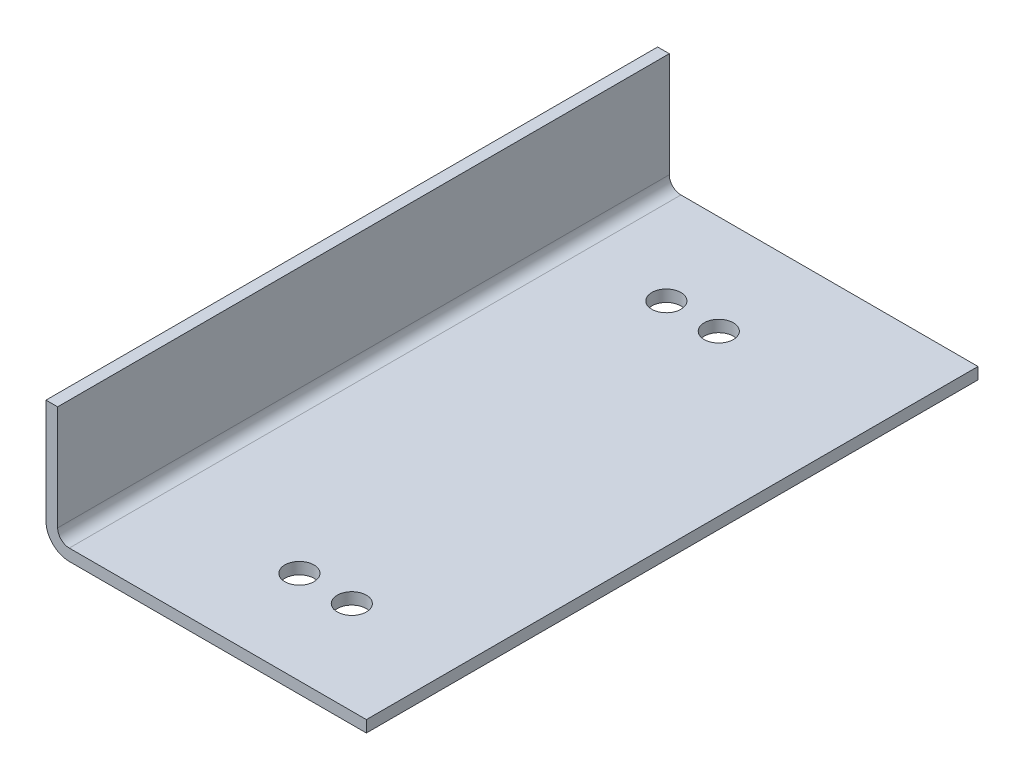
ISO-10303-21;
HEADER;
FILE_DESCRIPTION(('STEP AP214'),'2;1');
FILE_NAME('part.step','',(''),(''),'','','');
FILE_SCHEMA(('AUTOMOTIVE_DESIGN { 1 0 10303 214 1 1 1 1 }'));
ENDSEC;
DATA;
#1=APPLICATION_CONTEXT('core data for automotive mechanical design processes');
#2=APPLICATION_PROTOCOL_DEFINITION('international standard','automotive_design',2000,#1);
#3=PRODUCT_CONTEXT('',#1,'mechanical');
#4=PRODUCT('Part','Part','',(#3));
#5=PRODUCT_RELATED_PRODUCT_CATEGORY('part','',(#4));
#6=PRODUCT_DEFINITION_FORMATION('','',#4);
#7=PRODUCT_DEFINITION_CONTEXT('part definition',#1,'design');
#8=PRODUCT_DEFINITION('design','',#6,#7);
#9=PRODUCT_DEFINITION_SHAPE('','',#8);
#10=(LENGTH_UNIT() NAMED_UNIT(*) SI_UNIT(.MILLI.,.METRE.));
#11=(NAMED_UNIT(*) PLANE_ANGLE_UNIT() SI_UNIT($,.RADIAN.));
#12=(NAMED_UNIT(*) SI_UNIT($,.STERADIAN.) SOLID_ANGLE_UNIT());
#13=UNCERTAINTY_MEASURE_WITH_UNIT(LENGTH_MEASURE(1.E-05),#10,'distance_accuracy_value','');
#14=(GEOMETRIC_REPRESENTATION_CONTEXT(3) GLOBAL_UNCERTAINTY_ASSIGNED_CONTEXT((#13)) GLOBAL_UNIT_ASSIGNED_CONTEXT((#10,
#11,#12)) REPRESENTATION_CONTEXT('',''));
#15=CARTESIAN_POINT('',(0.,0.,0.));
#16=DIRECTION('',(0.,0.,1.));
#17=DIRECTION('',(1.,0.,0.));
#18=AXIS2_PLACEMENT_3D('',#15,#16,#17);
#19=CARTESIAN_POINT('',(2.,22.,105.));
#20=DIRECTION('',(0.,-1.,0.));
#21=DIRECTION('',(0.,0.,-1.));
#22=AXIS2_PLACEMENT_3D('',#19,#20,#21);
#23=PLANE('',#22);
#24=DIRECTION('',(-1.,0.,0.));
#25=VECTOR('',#24,1.);
#26=CARTESIAN_POINT('',(2.,22.,0.));
#27=LINE('',#26,#25);
#28=CARTESIAN_POINT('',(2.,22.,0.));
#29=VERTEX_POINT('',#28);
#30=CARTESIAN_POINT('',(0.,22.,0.));
#31=VERTEX_POINT('',#30);
#32=EDGE_CURVE('E130',#29,#31,#27,.T.);
#33=ORIENTED_EDGE('',*,*,#32,.T.);
#34=DIRECTION('',(0.,0.,-1.));
#35=VECTOR('',#34,1.);
#36=CARTESIAN_POINT('',(0.,22.,105.));
#37=LINE('',#36,#35);
#38=CARTESIAN_POINT('',(0.,22.,105.));
#39=VERTEX_POINT('',#38);
#40=EDGE_CURVE('E11',#39,#31,#37,.T.);
#41=ORIENTED_EDGE('',*,*,#40,.F.);
#42=DIRECTION('',(-1.,0.,0.));
#43=VECTOR('',#42,1.);
#44=CARTESIAN_POINT('',(2.,22.,105.));
#45=LINE('',#44,#43);
#46=CARTESIAN_POINT('',(2.,22.,105.));
#47=VERTEX_POINT('',#46);
#48=EDGE_CURVE('E145',#47,#39,#45,.T.);
#49=ORIENTED_EDGE('',*,*,#48,.F.);
#50=DIRECTION('',(0.,0.,-1.));
#51=VECTOR('',#50,1.);
#52=CARTESIAN_POINT('',(2.,22.,105.));
#53=LINE('',#52,#51);
#54=EDGE_CURVE('E126',#47,#29,#53,.T.);
#55=ORIENTED_EDGE('',*,*,#54,.T.);
#56=EDGE_LOOP('',(#33,#41,#49,#55));
#57=FACE_BOUND('',#56,.T.);
#58=ADVANCED_FACE('F34',(#57),#23,.F.);
#59=CARTESIAN_POINT('',(0.,4.00000000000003,105.));
#60=DIRECTION('',(1.,0.,0.));
#61=DIRECTION('',(0.,0.,-1.));
#62=AXIS2_PLACEMENT_3D('',#59,#60,#61);
#63=PLANE('',#62);
#64=DIRECTION('',(0.,-1.,0.));
#65=VECTOR('',#64,1.);
#66=CARTESIAN_POINT('',(0.,4.00000000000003,0.));
#67=LINE('',#66,#65);
#68=CARTESIAN_POINT('',(0.,4.00000000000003,0.));
#69=VERTEX_POINT('',#68);
#70=EDGE_CURVE('E133',#31,#69,#67,.T.);
#71=ORIENTED_EDGE('',*,*,#70,.T.);
#72=DIRECTION('',(0.,0.,-1.));
#73=VECTOR('',#72,1.);
#74=CARTESIAN_POINT('',(0.,4.00000000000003,105.));
#75=LINE('',#74,#73);
#76=CARTESIAN_POINT('',(0.,4.00000000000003,105.));
#77=VERTEX_POINT('',#76);
#78=EDGE_CURVE('E42',#77,#69,#75,.T.);
#79=ORIENTED_EDGE('',*,*,#78,.F.);
#80=DIRECTION('',(0.,-1.,0.));
#81=VECTOR('',#80,1.);
#82=CARTESIAN_POINT('',(0.,4.00000000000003,105.));
#83=LINE('',#82,#81);
#84=EDGE_CURVE('E93',#39,#77,#83,.T.);
#85=ORIENTED_EDGE('',*,*,#84,.F.);
#86=ORIENTED_EDGE('',*,*,#40,.T.);
#87=EDGE_LOOP('',(#71,#79,#85,#86));
#88=FACE_BOUND('',#87,.T.);
#89=ADVANCED_FACE('F234',(#88),#63,.F.);
#90=CARTESIAN_POINT('',(4.,4.,105.));
#91=DIRECTION('',(0.,0.,-1.));
#92=DIRECTION('',(-1.,0.,0.));
#93=AXIS2_PLACEMENT_3D('',#90,#91,#92);
#94=CYLINDRICAL_SURFACE('',#93,4.);
#95=CARTESIAN_POINT('',(4.,4.,0.));
#96=DIRECTION('',(0.,0.,1.));
#97=DIRECTION('',(1.,0.,0.));
#98=AXIS2_PLACEMENT_3D('',#95,#96,#97);
#99=CIRCLE('',#98,4.);
#100=CARTESIAN_POINT('',(4.00000000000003,0.,0.));
#101=VERTEX_POINT('',#100);
#102=EDGE_CURVE('E136',#69,#101,#99,.T.);
#103=ORIENTED_EDGE('',*,*,#102,.T.);
#104=DIRECTION('',(0.,0.,-1.));
#105=VECTOR('',#104,1.);
#106=CARTESIAN_POINT('',(4.00000000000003,0.,105.));
#107=LINE('',#106,#105);
#108=CARTESIAN_POINT('',(4.00000000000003,0.,105.));
#109=VERTEX_POINT('',#108);
#110=EDGE_CURVE('E152',#109,#101,#107,.T.);
#111=ORIENTED_EDGE('',*,*,#110,.F.);
#112=CARTESIAN_POINT('',(4.,4.,105.));
#113=DIRECTION('',(0.,0.,1.));
#114=DIRECTION('',(1.,0.,0.));
#115=AXIS2_PLACEMENT_3D('',#112,#113,#114);
#116=CIRCLE('',#115,4.);
#117=EDGE_CURVE('E160',#77,#109,#116,.T.);
#118=ORIENTED_EDGE('',*,*,#117,.F.);
#119=ORIENTED_EDGE('',*,*,#78,.T.);
#120=EDGE_LOOP('',(#103,#111,#118,#119));
#121=FACE_BOUND('',#120,.T.);
#122=ADVANCED_FACE('F158',(#121),#94,.T.);
#123=CARTESIAN_POINT('',(4.00000000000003,0.,105.));
#124=DIRECTION('',(0.,1.,0.));
#125=DIRECTION('',(0.,0.,1.));
#126=AXIS2_PLACEMENT_3D('',#123,#124,#125);
#127=PLANE('',#126);
#128=CARTESIAN_POINT('',(36.4999999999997,0.,89.));
#129=DIRECTION('',(0.,-1.,0.));
#130=DIRECTION('',(0.,0.,-1.));
#131=AXIS2_PLACEMENT_3D('',#128,#129,#130);
#132=CIRCLE('',#131,2.5);
#133=CARTESIAN_POINT('',(36.4999999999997,0.,86.5));
#134=VERTEX_POINT('',#133);
#135=EDGE_CURVE('E198',#134,#134,#132,.T.);
#136=ORIENTED_EDGE('',*,*,#135,.F.);
#137=EDGE_LOOP('',(#136));
#138=FACE_BOUND('',#137,.T.);
#139=CARTESIAN_POINT('',(27.4999999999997,0.,89.));
#140=DIRECTION('',(0.,-1.,0.));
#141=DIRECTION('',(0.,0.,-1.));
#142=AXIS2_PLACEMENT_3D('',#139,#140,#141);
#143=CIRCLE('',#142,2.5);
#144=CARTESIAN_POINT('',(27.4999999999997,0.,86.5));
#145=VERTEX_POINT('',#144);
#146=EDGE_CURVE('E192',#145,#145,#143,.T.);
#147=ORIENTED_EDGE('',*,*,#146,.F.);
#148=EDGE_LOOP('',(#147));
#149=FACE_BOUND('',#148,.T.);
#150=CARTESIAN_POINT('',(27.5,0.,17.));
#151=DIRECTION('',(0.,-1.,0.));
#152=DIRECTION('',(0.,0.,-1.));
#153=AXIS2_PLACEMENT_3D('',#150,#151,#152);
#154=CIRCLE('',#153,2.5);
#155=CARTESIAN_POINT('',(27.5,0.,14.5));
#156=VERTEX_POINT('',#155);
#157=EDGE_CURVE('E186',#156,#156,#154,.T.);
#158=ORIENTED_EDGE('',*,*,#157,.F.);
#159=EDGE_LOOP('',(#158));
#160=FACE_BOUND('',#159,.T.);
#161=CARTESIAN_POINT('',(18.5,0.,17.));
#162=DIRECTION('',(0.,-1.,0.));
#163=DIRECTION('',(0.,0.,-1.));
#164=AXIS2_PLACEMENT_3D('',#161,#162,#163);
#165=CIRCLE('',#164,2.5);
#166=CARTESIAN_POINT('',(18.5,0.,14.5));
#167=VERTEX_POINT('',#166);
#168=EDGE_CURVE('E180',#167,#167,#165,.T.);
#169=ORIENTED_EDGE('',*,*,#168,.F.);
#170=EDGE_LOOP('',(#169));
#171=FACE_BOUND('',#170,.T.);
#172=DIRECTION('',(1.,0.,0.));
#173=VECTOR('',#172,1.);
#174=CARTESIAN_POINT('',(4.00000000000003,0.,0.));
#175=LINE('',#174,#173);
#176=CARTESIAN_POINT('',(55.,0.,0.));
#177=VERTEX_POINT('',#176);
#178=EDGE_CURVE('E138',#101,#177,#175,.T.);
#179=ORIENTED_EDGE('',*,*,#178,.T.);
#180=DIRECTION('',(0.,0.,-1.));
#181=VECTOR('',#180,1.);
#182=CARTESIAN_POINT('',(55.,0.,105.));
#183=LINE('',#182,#181);
#184=CARTESIAN_POINT('',(55.,0.,105.));
#185=VERTEX_POINT('',#184);
#186=EDGE_CURVE('E149',#185,#177,#183,.T.);
#187=ORIENTED_EDGE('',*,*,#186,.F.);
#188=DIRECTION('',(1.,0.,0.));
#189=VECTOR('',#188,1.);
#190=CARTESIAN_POINT('',(4.00000000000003,0.,105.));
#191=LINE('',#190,#189);
#192=EDGE_CURVE('E172',#109,#185,#191,.T.);
#193=ORIENTED_EDGE('',*,*,#192,.F.);
#194=ORIENTED_EDGE('',*,*,#110,.T.);
#195=EDGE_LOOP('',(#179,#187,#193,#194));
#196=FACE_BOUND('',#195,.T.);
#197=ADVANCED_FACE('F168',(#138,#149,#160,#171,#196),#127,.F.);
#198=CARTESIAN_POINT('',(55.,0.,105.));
#199=DIRECTION('',(-1.,0.,0.));
#200=DIRECTION('',(0.,0.,1.));
#201=AXIS2_PLACEMENT_3D('',#198,#199,#200);
#202=PLANE('',#201);
#203=DIRECTION('',(0.,1.,0.));
#204=VECTOR('',#203,1.);
#205=CARTESIAN_POINT('',(55.,0.,0.));
#206=LINE('',#205,#204);
#207=CARTESIAN_POINT('',(55.,2.,0.));
#208=VERTEX_POINT('',#207);
#209=EDGE_CURVE('E140',#177,#208,#206,.T.);
#210=ORIENTED_EDGE('',*,*,#209,.T.);
#211=DIRECTION('',(0.,0.,-1.));
#212=VECTOR('',#211,1.);
#213=CARTESIAN_POINT('',(55.,2.,105.));
#214=LINE('',#213,#212);
#215=CARTESIAN_POINT('',(55.,2.,105.));
#216=VERTEX_POINT('',#215);
#217=EDGE_CURVE('E121',#216,#208,#214,.T.);
#218=ORIENTED_EDGE('',*,*,#217,.F.);
#219=DIRECTION('',(0.,1.,0.));
#220=VECTOR('',#219,1.);
#221=CARTESIAN_POINT('',(55.,0.,105.));
#222=LINE('',#221,#220);
#223=EDGE_CURVE('E112',#185,#216,#222,.T.);
#224=ORIENTED_EDGE('',*,*,#223,.F.);
#225=ORIENTED_EDGE('',*,*,#186,.T.);
#226=EDGE_LOOP('',(#210,#218,#224,#225));
#227=FACE_BOUND('',#226,.T.);
#228=ADVANCED_FACE('F171',(#227),#202,.F.);
#229=CARTESIAN_POINT('',(55.,2.,105.));
#230=DIRECTION('',(0.,-1.,0.));
#231=DIRECTION('',(1.,0.,0.));
#232=AXIS2_PLACEMENT_3D('',#229,#230,#231);
#233=PLANE('',#232);
#234=CARTESIAN_POINT('',(36.4999999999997,2.,89.));
#235=DIRECTION('',(0.,-1.,0.));
#236=DIRECTION('',(1.,0.,0.));
#237=AXIS2_PLACEMENT_3D('',#234,#235,#236);
#238=CIRCLE('',#237,2.5);
#239=CARTESIAN_POINT('',(38.9999999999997,2.,89.));
#240=VERTEX_POINT('',#239);
#241=EDGE_CURVE('E195',#240,#240,#238,.F.);
#242=ORIENTED_EDGE('',*,*,#241,.F.);
#243=EDGE_LOOP('',(#242));
#244=FACE_BOUND('',#243,.T.);
#245=CARTESIAN_POINT('',(27.4999999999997,2.,89.));
#246=DIRECTION('',(0.,-1.,0.));
#247=DIRECTION('',(1.,0.,0.));
#248=AXIS2_PLACEMENT_3D('',#245,#246,#247);
#249=CIRCLE('',#248,2.5);
#250=CARTESIAN_POINT('',(29.9999999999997,2.,89.));
#251=VERTEX_POINT('',#250);
#252=EDGE_CURVE('E189',#251,#251,#249,.F.);
#253=ORIENTED_EDGE('',*,*,#252,.F.);
#254=EDGE_LOOP('',(#253));
#255=FACE_BOUND('',#254,.T.);
#256=CARTESIAN_POINT('',(27.5,2.,17.));
#257=DIRECTION('',(0.,-1.,0.));
#258=DIRECTION('',(1.,0.,0.));
#259=AXIS2_PLACEMENT_3D('',#256,#257,#258);
#260=CIRCLE('',#259,2.5);
#261=CARTESIAN_POINT('',(30.,2.,17.));
#262=VERTEX_POINT('',#261);
#263=EDGE_CURVE('E183',#262,#262,#260,.F.);
#264=ORIENTED_EDGE('',*,*,#263,.F.);
#265=EDGE_LOOP('',(#264));
#266=FACE_BOUND('',#265,.T.);
#267=CARTESIAN_POINT('',(18.5,2.,17.));
#268=DIRECTION('',(0.,-1.,0.));
#269=DIRECTION('',(1.,0.,0.));
#270=AXIS2_PLACEMENT_3D('',#267,#268,#269);
#271=CIRCLE('',#270,2.5);
#272=CARTESIAN_POINT('',(21.,2.,17.));
#273=VERTEX_POINT('',#272);
#274=EDGE_CURVE('E134',#273,#273,#271,.F.);
#275=ORIENTED_EDGE('',*,*,#274,.F.);
#276=EDGE_LOOP('',(#275));
#277=FACE_BOUND('',#276,.T.);
#278=DIRECTION('',(-1.,0.,0.));
#279=VECTOR('',#278,1.);
#280=CARTESIAN_POINT('',(55.,2.,0.));
#281=LINE('',#280,#279);
#282=CARTESIAN_POINT('',(4.00000000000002,1.99999999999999,0.));
#283=VERTEX_POINT('',#282);
#284=EDGE_CURVE('E120',#208,#283,#281,.T.);
#285=ORIENTED_EDGE('',*,*,#284,.T.);
#286=DIRECTION('',(0.,0.,-1.));
#287=VECTOR('',#286,1.);
#288=CARTESIAN_POINT('',(4.00000000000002,1.99999999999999,105.));
#289=LINE('',#288,#287);
#290=CARTESIAN_POINT('',(4.00000000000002,1.99999999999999,105.));
#291=VERTEX_POINT('',#290);
#292=EDGE_CURVE('E117',#291,#283,#289,.T.);
#293=ORIENTED_EDGE('',*,*,#292,.F.);
#294=DIRECTION('',(-1.,0.,0.));
#295=VECTOR('',#294,1.);
#296=CARTESIAN_POINT('',(55.,2.,105.));
#297=LINE('',#296,#295);
#298=EDGE_CURVE('E106',#216,#291,#297,.T.);
#299=ORIENTED_EDGE('',*,*,#298,.F.);
#300=ORIENTED_EDGE('',*,*,#217,.T.);
#301=EDGE_LOOP('',(#285,#293,#299,#300));
#302=FACE_BOUND('',#301,.T.);
#303=ADVANCED_FACE('F118',(#244,#255,#266,#277,#302),#233,.F.);
#304=CARTESIAN_POINT('',(4.,3.99999999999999,105.));
#305=DIRECTION('',(0.,0.,-1.));
#306=DIRECTION('',(-1.,0.,0.));
#307=AXIS2_PLACEMENT_3D('',#304,#305,#306);
#308=CYLINDRICAL_SURFACE('',#307,2.);
#309=CARTESIAN_POINT('',(4.,3.99999999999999,0.));
#310=DIRECTION('',(0.,0.,-1.));
#311=DIRECTION('',(-1.,0.,0.));
#312=AXIS2_PLACEMENT_3D('',#309,#310,#311);
#313=CIRCLE('',#312,2.);
#314=CARTESIAN_POINT('',(2.,4.00000000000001,0.));
#315=VERTEX_POINT('',#314);
#316=EDGE_CURVE('E79',#283,#315,#313,.T.);
#317=ORIENTED_EDGE('',*,*,#316,.T.);
#318=DIRECTION('',(0.,0.,-1.));
#319=VECTOR('',#318,1.);
#320=CARTESIAN_POINT('',(2.,4.00000000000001,105.));
#321=LINE('',#320,#319);
#322=CARTESIAN_POINT('',(2.,4.00000000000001,105.));
#323=VERTEX_POINT('',#322);
#324=EDGE_CURVE('E122',#323,#315,#321,.T.);
#325=ORIENTED_EDGE('',*,*,#324,.F.);
#326=CARTESIAN_POINT('',(4.,3.99999999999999,105.));
#327=DIRECTION('',(0.,0.,-1.));
#328=DIRECTION('',(-1.,0.,0.));
#329=AXIS2_PLACEMENT_3D('',#326,#327,#328);
#330=CIRCLE('',#329,2.);
#331=EDGE_CURVE('E110',#291,#323,#330,.T.);
#332=ORIENTED_EDGE('',*,*,#331,.F.);
#333=ORIENTED_EDGE('',*,*,#292,.T.);
#334=EDGE_LOOP('',(#317,#325,#332,#333));
#335=FACE_BOUND('',#334,.T.);
#336=ADVANCED_FACE('F124',(#335),#308,.F.);
#337=CARTESIAN_POINT('',(2.,4.00000000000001,105.));
#338=DIRECTION('',(-1.,0.,0.));
#339=DIRECTION('',(0.,-1.,0.));
#340=AXIS2_PLACEMENT_3D('',#337,#338,#339);
#341=PLANE('',#340);
#342=DIRECTION('',(0.,1.,0.));
#343=VECTOR('',#342,1.);
#344=CARTESIAN_POINT('',(2.,4.00000000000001,0.));
#345=LINE('',#344,#343);
#346=EDGE_CURVE('E85',#315,#29,#345,.T.);
#347=ORIENTED_EDGE('',*,*,#346,.T.);
#348=ORIENTED_EDGE('',*,*,#54,.F.);
#349=DIRECTION('',(0.,1.,0.));
#350=VECTOR('',#349,1.);
#351=CARTESIAN_POINT('',(2.,4.00000000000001,105.));
#352=LINE('',#351,#350);
#353=EDGE_CURVE('E50',#323,#47,#352,.T.);
#354=ORIENTED_EDGE('',*,*,#353,.F.);
#355=ORIENTED_EDGE('',*,*,#324,.T.);
#356=EDGE_LOOP('',(#347,#348,#354,#355));
#357=FACE_BOUND('',#356,.T.);
#358=ADVANCED_FACE('F228',(#357),#341,.F.);
#359=CARTESIAN_POINT('',(4.,4.,105.));
#360=DIRECTION('',(0.,0.,1.));
#361=DIRECTION('',(1.,0.,0.));
#362=AXIS2_PLACEMENT_3D('',#359,#360,#361);
#363=PLANE('',#362);
#364=ORIENTED_EDGE('',*,*,#48,.T.);
#365=ORIENTED_EDGE('',*,*,#84,.T.);
#366=ORIENTED_EDGE('',*,*,#117,.T.);
#367=ORIENTED_EDGE('',*,*,#192,.T.);
#368=ORIENTED_EDGE('',*,*,#223,.T.);
#369=ORIENTED_EDGE('',*,*,#298,.T.);
#370=ORIENTED_EDGE('',*,*,#331,.T.);
#371=ORIENTED_EDGE('',*,*,#353,.T.);
#372=EDGE_LOOP('',(#364,#365,#366,#367,#368,#369,#370,#371));
#373=FACE_BOUND('',#372,.T.);
#374=ADVANCED_FACE('F108',(#373),#363,.T.);
#375=CARTESIAN_POINT('',(4.,4.,0.));
#376=DIRECTION('',(0.,0.,1.));
#377=DIRECTION('',(1.,0.,0.));
#378=AXIS2_PLACEMENT_3D('',#375,#376,#377);
#379=PLANE('',#378);
#380=ORIENTED_EDGE('',*,*,#32,.F.);
#381=ORIENTED_EDGE('',*,*,#346,.F.);
#382=ORIENTED_EDGE('',*,*,#316,.F.);
#383=ORIENTED_EDGE('',*,*,#284,.F.);
#384=ORIENTED_EDGE('',*,*,#209,.F.);
#385=ORIENTED_EDGE('',*,*,#178,.F.);
#386=ORIENTED_EDGE('',*,*,#102,.F.);
#387=ORIENTED_EDGE('',*,*,#70,.F.);
#388=EDGE_LOOP('',(#380,#381,#382,#383,#384,#385,#386,#387));
#389=FACE_BOUND('',#388,.T.);
#390=ADVANCED_FACE('F164',(#389),#379,.F.);
#391=CARTESIAN_POINT('',(18.5,22.001,17.));
#392=DIRECTION('',(0.,-1.,0.));
#393=DIRECTION('',(0.,0.,-1.));
#394=AXIS2_PLACEMENT_3D('',#391,#392,#393);
#395=CYLINDRICAL_SURFACE('',#394,2.5);
#396=ORIENTED_EDGE('',*,*,#168,.T.);
#397=EDGE_LOOP('',(#396));
#398=FACE_BOUND('',#397,.T.);
#399=ORIENTED_EDGE('',*,*,#274,.T.);
#400=EDGE_LOOP('',(#399));
#401=FACE_BOUND('',#400,.T.);
#402=ADVANCED_FACE('F214',(#398,#401),#395,.F.);
#403=CARTESIAN_POINT('',(27.5,22.001,17.));
#404=DIRECTION('',(0.,-1.,0.));
#405=DIRECTION('',(0.,0.,-1.));
#406=AXIS2_PLACEMENT_3D('',#403,#404,#405);
#407=CYLINDRICAL_SURFACE('',#406,2.5);
#408=ORIENTED_EDGE('',*,*,#157,.T.);
#409=EDGE_LOOP('',(#408));
#410=FACE_BOUND('',#409,.T.);
#411=ORIENTED_EDGE('',*,*,#263,.T.);
#412=EDGE_LOOP('',(#411));
#413=FACE_BOUND('',#412,.T.);
#414=ADVANCED_FACE('F217',(#410,#413),#407,.F.);
#415=CARTESIAN_POINT('',(27.4999999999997,22.001,89.));
#416=DIRECTION('',(0.,-1.,0.));
#417=DIRECTION('',(0.,0.,-1.));
#418=AXIS2_PLACEMENT_3D('',#415,#416,#417);
#419=CYLINDRICAL_SURFACE('',#418,2.5);
#420=ORIENTED_EDGE('',*,*,#146,.T.);
#421=EDGE_LOOP('',(#420));
#422=FACE_BOUND('',#421,.T.);
#423=ORIENTED_EDGE('',*,*,#252,.T.);
#424=EDGE_LOOP('',(#423));
#425=FACE_BOUND('',#424,.T.);
#426=ADVANCED_FACE('F252',(#422,#425),#419,.F.);
#427=CARTESIAN_POINT('',(36.4999999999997,22.001,89.));
#428=DIRECTION('',(0.,-1.,0.));
#429=DIRECTION('',(0.,0.,-1.));
#430=AXIS2_PLACEMENT_3D('',#427,#428,#429);
#431=CYLINDRICAL_SURFACE('',#430,2.5);
#432=ORIENTED_EDGE('',*,*,#135,.T.);
#433=EDGE_LOOP('',(#432));
#434=FACE_BOUND('',#433,.T.);
#435=ORIENTED_EDGE('',*,*,#241,.T.);
#436=EDGE_LOOP('',(#435));
#437=FACE_BOUND('',#436,.T.);
#438=ADVANCED_FACE('F202',(#434,#437),#431,.F.);
#439=CLOSED_SHELL('',(#58,#89,#122,#197,#228,#303,#336,#358,#374,#390,#402,#414,#426,#438));
#440=MANIFOLD_SOLID_BREP('B2',#439);
#441=ADVANCED_BREP_SHAPE_REPRESENTATION('',(#18,#440),#14);
#442=SHAPE_DEFINITION_REPRESENTATION(#9,#441);
ENDSEC;
END-ISO-10303-21;
